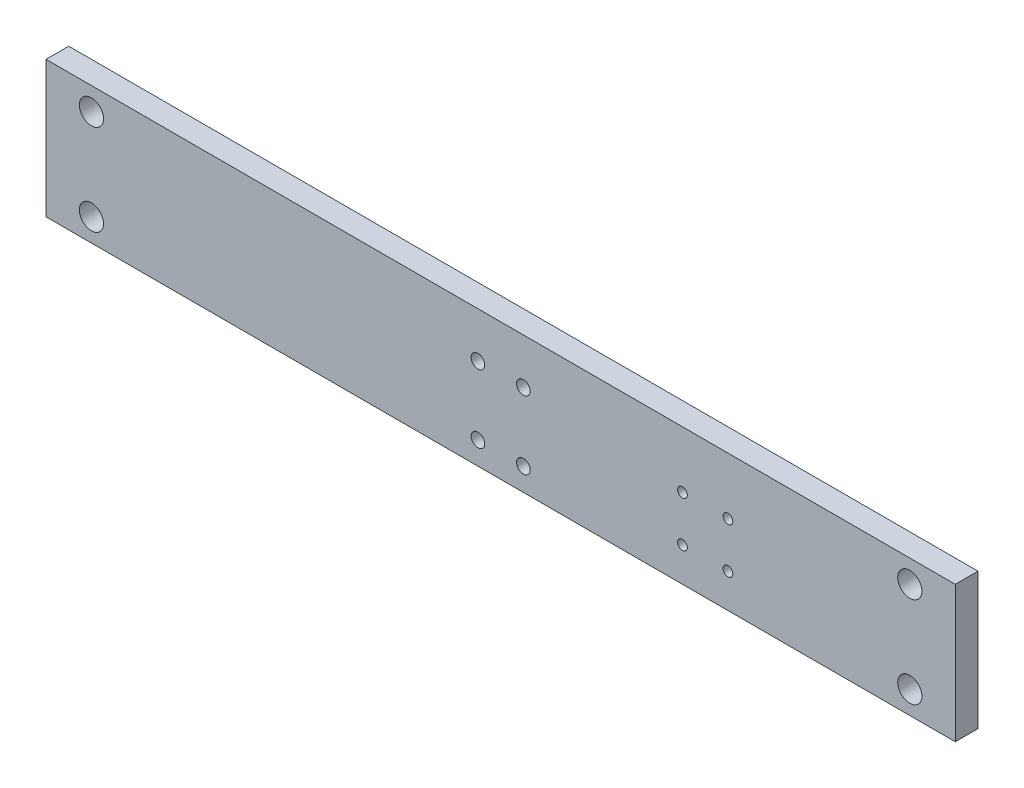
from build123d import *

# Parameters (mm, degrees)
SKETCH1_W                 = 254
SKETCH1_H                 = 38.1
EXTRUDE1_DEPTH            = 6.35
F_6_CLEARANCE_HOLE1_D     = 3.7973
F_6_CLEARANCE_HOLE1_DEPTH = 78.74
F_6_CLEARANCE_HOLE1_TIP   = 1.140824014
F_1_4_CLEARANCE_HOLE1_D   = 6.7564
F_6_32_TAPPED_HOLE2_D     = 2.7051


with BuildPart() as part:
    # Sketch1 → Extrude1 (new body)
    with BuildSketch(Plane.XY):
        Rectangle(SKETCH1_W, SKETCH1_H)
    extrude(amount=EXTRUDE1_DEPTH)

    # 6 Clearance Hole1
    with Locations(Plane(origin=(0, 0, 0), x_dir=(-1, 0, 0), z_dir=(0, 0, -1))):
        with Locations((-6.35, -12.7), (6.35, -12.7), (-6.35, 6.35), (6.35, 6.35)):
            Hole(F_6_CLEARANCE_HOLE1_D / 2, depth=F_6_CLEARANCE_HOLE1_DEPTH)
            with Locations((0, 0, -(F_6_CLEARANCE_HOLE1_DEPTH + F_6_CLEARANCE_HOLE1_TIP / 2))):  # 118° drill point
                Cone(0, F_6_CLEARANCE_HOLE1_D / 2, F_6_CLEARANCE_HOLE1_TIP, mode=Mode.SUBTRACT)

    # 1_4 Clearance Hole1 (through all)
    with Locations(Plane.XY.offset(6.35)):
        with Locations((-114.3, 12.7), (-114.3, -12.7), (114.3, -12.7), (114.3, 12.7)):
            Hole(F_1_4_CLEARANCE_HOLE1_D / 2)

    # 6-32 Tapped Hole2 (through all)
    with Locations(Plane(origin=(0, 0, 0), x_dir=(-1, 0, 0), z_dir=(0, 0, -1))):
        with Locations((-50.8, 3.175), (-50.8, -9.525), (-63.5, -9.525), (-63.5, 3.175)):
            Hole(F_6_32_TAPPED_HOLE2_D / 2)


solid = part.part
